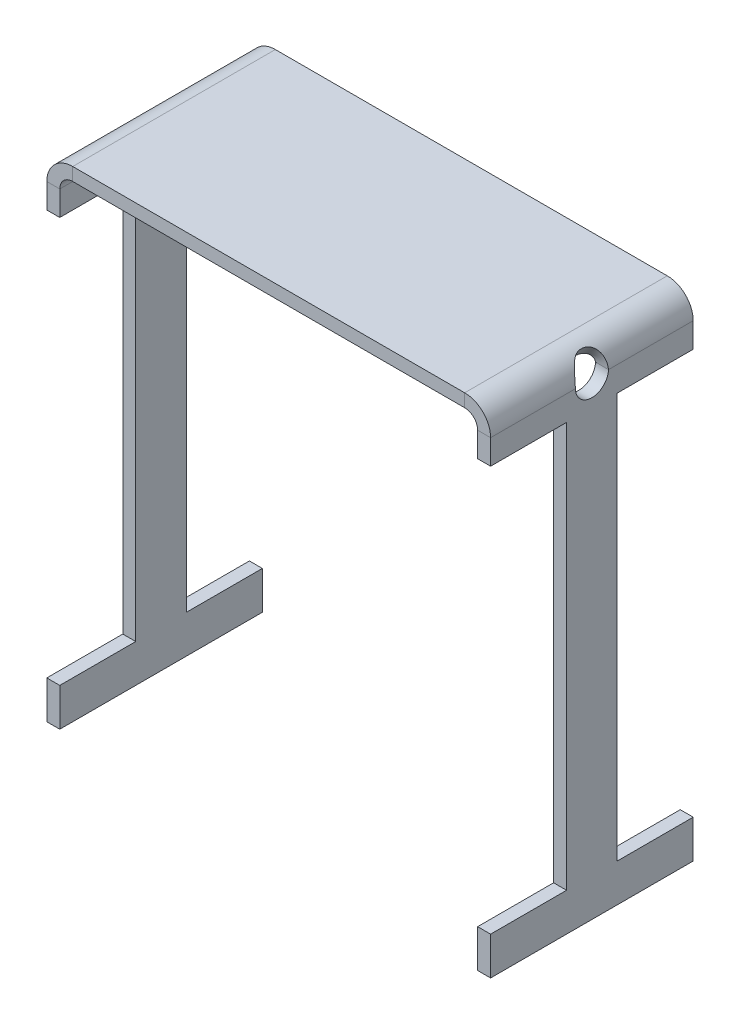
ISO-10303-21;
HEADER;
FILE_DESCRIPTION(('STEP AP214'),'2;1');
FILE_NAME('part.step','',(''),(''),'','','');
FILE_SCHEMA(('AUTOMOTIVE_DESIGN { 1 0 10303 214 1 1 1 1 }'));
ENDSEC;
DATA;
#1=APPLICATION_CONTEXT('core data for automotive mechanical design processes');
#2=APPLICATION_PROTOCOL_DEFINITION('international standard','automotive_design',2000,#1);
#3=PRODUCT_CONTEXT('',#1,'mechanical');
#4=PRODUCT('Part','Part','',(#3));
#5=PRODUCT_RELATED_PRODUCT_CATEGORY('part','',(#4));
#6=PRODUCT_DEFINITION_FORMATION('','',#4);
#7=PRODUCT_DEFINITION_CONTEXT('part definition',#1,'design');
#8=PRODUCT_DEFINITION('design','',#6,#7);
#9=PRODUCT_DEFINITION_SHAPE('','',#8);
#10=(LENGTH_UNIT() NAMED_UNIT(*) SI_UNIT(.MILLI.,.METRE.));
#11=(NAMED_UNIT(*) PLANE_ANGLE_UNIT() SI_UNIT($,.RADIAN.));
#12=(NAMED_UNIT(*) SI_UNIT($,.STERADIAN.) SOLID_ANGLE_UNIT());
#13=UNCERTAINTY_MEASURE_WITH_UNIT(LENGTH_MEASURE(1.E-05),#10,'distance_accuracy_value','');
#14=(GEOMETRIC_REPRESENTATION_CONTEXT(3) GLOBAL_UNCERTAINTY_ASSIGNED_CONTEXT((#13)) GLOBAL_UNIT_ASSIGNED_CONTEXT((#10,
#11,#12)) REPRESENTATION_CONTEXT('',''));
#15=CARTESIAN_POINT('',(0.,0.,0.));
#16=DIRECTION('',(0.,0.,1.));
#17=DIRECTION('',(1.,0.,0.));
#18=AXIS2_PLACEMENT_3D('',#15,#16,#17);
#19=CARTESIAN_POINT('',(-13.096875,30.14345,6.35));
#20=DIRECTION('',(0.,1.,0.));
#21=DIRECTION('',(0.,0.,1.));
#22=AXIS2_PLACEMENT_3D('',#19,#20,#21);
#23=PLANE('',#22);
#24=DIRECTION('',(0.,0.,1.));
#25=VECTOR('',#24,1.);
#26=CARTESIAN_POINT('',(-12.284075,30.14345,-6.35));
#27=LINE('',#26,#25);
#28=CARTESIAN_POINT('',(-12.284075,30.14345,-6.35));
#29=VERTEX_POINT('',#28);
#30=CARTESIAN_POINT('',(-12.284075,30.14345,6.35));
#31=VERTEX_POINT('',#30);
#32=EDGE_CURVE('E48',#29,#31,#27,.T.);
#33=ORIENTED_EDGE('',*,*,#32,.F.);
#34=DIRECTION('',(1.,0.,0.));
#35=VECTOR('',#34,1.);
#36=CARTESIAN_POINT('',(-13.096875,30.14345,-6.35));
#37=LINE('',#36,#35);
#38=CARTESIAN_POINT('',(12.284075,30.14345,-6.35));
#39=VERTEX_POINT('',#38);
#40=EDGE_CURVE('E63',#29,#39,#37,.T.);
#41=ORIENTED_EDGE('',*,*,#40,.T.);
#42=DIRECTION('',(0.,0.,-1.));
#43=VECTOR('',#42,1.);
#44=CARTESIAN_POINT('',(12.284075,30.14345,6.35));
#45=LINE('',#44,#43);
#46=CARTESIAN_POINT('',(12.284075,30.14345,6.35));
#47=VERTEX_POINT('',#46);
#48=EDGE_CURVE('E533',#47,#39,#45,.T.);
#49=ORIENTED_EDGE('',*,*,#48,.F.);
#50=DIRECTION('',(1.,0.,0.));
#51=VECTOR('',#50,1.);
#52=CARTESIAN_POINT('',(-13.096875,30.14345,6.35));
#53=LINE('',#52,#51);
#54=EDGE_CURVE('E55',#31,#47,#53,.T.);
#55=ORIENTED_EDGE('',*,*,#54,.F.);
#56=EDGE_LOOP('',(#33,#41,#49,#55));
#57=FACE_BOUND('',#56,.T.);
#58=ADVANCED_FACE('F41',(#57),#23,.F.);
#59=CARTESIAN_POINT('',(-13.096875,30.95625,6.35));
#60=DIRECTION('',(0.,1.,0.));
#61=DIRECTION('',(0.,0.,1.));
#62=AXIS2_PLACEMENT_3D('',#59,#60,#61);
#63=PLANE('',#62);
#64=DIRECTION('',(1.,0.,0.));
#65=VECTOR('',#64,1.);
#66=CARTESIAN_POINT('',(-13.096875,30.95625,-6.35));
#67=LINE('',#66,#65);
#68=CARTESIAN_POINT('',(-12.284075,30.95625,-6.35));
#69=VERTEX_POINT('',#68);
#70=CARTESIAN_POINT('',(12.284075,30.9562500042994,-6.35));
#71=VERTEX_POINT('',#70);
#72=EDGE_CURVE('E522',#69,#71,#67,.T.);
#73=ORIENTED_EDGE('',*,*,#72,.F.);
#74=DIRECTION('',(0.,0.,1.));
#75=VECTOR('',#74,1.);
#76=CARTESIAN_POINT('',(-12.284075,30.95625,-6.35));
#77=LINE('',#76,#75);
#78=CARTESIAN_POINT('',(-12.284075,30.9562500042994,6.35));
#79=VERTEX_POINT('',#78);
#80=EDGE_CURVE('E539',#69,#79,#77,.T.);
#81=ORIENTED_EDGE('',*,*,#80,.T.);
#82=DIRECTION('',(1.,0.,0.));
#83=VECTOR('',#82,1.);
#84=CARTESIAN_POINT('',(-13.096875,30.95625,6.35));
#85=LINE('',#84,#83);
#86=CARTESIAN_POINT('',(12.284075,30.95625,6.35));
#87=VERTEX_POINT('',#86);
#88=EDGE_CURVE('E525',#79,#87,#85,.T.);
#89=ORIENTED_EDGE('',*,*,#88,.T.);
#90=DIRECTION('',(0.,0.,-1.));
#91=VECTOR('',#90,1.);
#92=CARTESIAN_POINT('',(12.284075,30.95625,6.35));
#93=LINE('',#92,#91);
#94=EDGE_CURVE('E527',#87,#71,#93,.T.);
#95=ORIENTED_EDGE('',*,*,#94,.T.);
#96=EDGE_LOOP('',(#73,#81,#89,#95));
#97=FACE_BOUND('',#96,.T.);
#98=ADVANCED_FACE('F638',(#97),#63,.T.);
#99=CARTESIAN_POINT('',(13.096875,30.14345,6.35));
#100=DIRECTION('',(0.,0.,-1.));
#101=DIRECTION('',(-1.,0.,0.));
#102=AXIS2_PLACEMENT_3D('',#99,#100,#101);
#103=PLANE('',#102);
#104=DIRECTION('',(0.,1.,0.));
#105=VECTOR('',#104,1.);
#106=CARTESIAN_POINT('',(-12.284075,30.14345,6.35));
#107=LINE('',#106,#105);
#108=EDGE_CURVE('E12',#31,#79,#107,.T.);
#109=ORIENTED_EDGE('',*,*,#108,.F.);
#110=ORIENTED_EDGE('',*,*,#54,.T.);
#111=DIRECTION('',(0.,1.,0.));
#112=VECTOR('',#111,1.);
#113=CARTESIAN_POINT('',(12.284075,30.14345,6.35));
#114=LINE('',#113,#112);
#115=EDGE_CURVE('E530',#47,#87,#114,.T.);
#116=ORIENTED_EDGE('',*,*,#115,.T.);
#117=ORIENTED_EDGE('',*,*,#88,.F.);
#118=EDGE_LOOP('',(#109,#110,#116,#117));
#119=FACE_BOUND('',#118,.T.);
#120=ADVANCED_FACE('F640',(#119),#103,.F.);
#121=CARTESIAN_POINT('',(13.096875,30.14345,-6.35));
#122=DIRECTION('',(0.,0.,-1.));
#123=DIRECTION('',(-1.,0.,0.));
#124=AXIS2_PLACEMENT_3D('',#121,#122,#123);
#125=PLANE('',#124);
#126=ORIENTED_EDGE('',*,*,#40,.F.);
#127=DIRECTION('',(0.,1.,0.));
#128=VECTOR('',#127,1.);
#129=CARTESIAN_POINT('',(-12.284075,30.14345,-6.35));
#130=LINE('',#129,#128);
#131=EDGE_CURVE('E587',#29,#69,#130,.T.);
#132=ORIENTED_EDGE('',*,*,#131,.T.);
#133=ORIENTED_EDGE('',*,*,#72,.T.);
#134=DIRECTION('',(0.,1.,0.));
#135=VECTOR('',#134,1.);
#136=CARTESIAN_POINT('',(12.284075,30.14345,-6.35));
#137=LINE('',#136,#135);
#138=EDGE_CURVE('E536',#39,#71,#137,.T.);
#139=ORIENTED_EDGE('',*,*,#138,.F.);
#140=EDGE_LOOP('',(#126,#132,#133,#139));
#141=FACE_BOUND('',#140,.T.);
#142=ADVANCED_FACE('F476',(#141),#125,.T.);
#143=CARTESIAN_POINT('',(13.9096750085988,29.33065,1.04070281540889));
#144=CARTESIAN_POINT('',(13.9096750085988,29.5245298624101,1.04113754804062));
#145=CARTESIAN_POINT('',(13.8751189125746,29.702292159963,1.0223352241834));
#146=CARTESIAN_POINT('',(13.795272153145,29.9352981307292,0.965279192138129));
#147=CARTESIAN_POINT('',(13.7639795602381,30.0074415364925,0.941451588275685));
#148=CARTESIAN_POINT('',(13.7127061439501,30.1071715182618,0.898496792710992));
#149=CARTESIAN_POINT('',(13.694889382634,30.1390072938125,0.882976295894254));
#150=CARTESIAN_POINT('',(13.6673788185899,30.1846767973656,0.857892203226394));
#151=CARTESIAN_POINT('',(13.6580774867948,30.1995529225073,0.849230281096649));
#152=CARTESIAN_POINT('',(13.6439644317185,30.2213525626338,0.83578656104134));
#153=CARTESIAN_POINT('',(13.6392332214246,30.2285333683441,0.831230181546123));
#154=CARTESIAN_POINT('',(13.6321004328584,30.2391768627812,0.824282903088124));
#155=CARTESIAN_POINT('',(13.629716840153,30.242703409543,0.821948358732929));
#156=CARTESIAN_POINT('',(13.6261329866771,30.2479614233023,0.818418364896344));
#157=CARTESIAN_POINT('',(13.6249369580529,30.2497087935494,0.817237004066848));
#158=CARTESIAN_POINT('',(13.6225421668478,30.2531929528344,0.814864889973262));
#159=CARTESIAN_POINT('',(13.6217836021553,30.2542946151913,0.814112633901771));
#160=CARTESIAN_POINT('',(13.5151651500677,30.4081259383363,0.707906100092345));
#161=CARTESIAN_POINT('',(13.4133543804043,30.5035468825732,0.588273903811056));
#162=CARTESIAN_POINT('',(13.3092153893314,30.5930914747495,0.386236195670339));
#163=CARTESIAN_POINT('',(13.2821284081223,30.6139954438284,0.315125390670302));
#164=CARTESIAN_POINT('',(13.2550819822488,30.6344323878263,0.202811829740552));
#165=CARTESIAN_POINT('',(13.2483123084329,30.639409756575,0.164432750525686));
#166=CARTESIAN_POINT('',(13.2416483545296,30.6442847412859,0.105452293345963));
#167=CARTESIAN_POINT('',(13.2400078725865,30.645476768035,0.0855568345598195));
#168=CARTESIAN_POINT('',(13.2384256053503,30.6466252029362,0.0553606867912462));
#169=CARTESIAN_POINT('',(13.238044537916,30.6469013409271,0.0452364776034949));
#170=CARTESIAN_POINT('',(13.2375756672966,30.6472410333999,0.0248704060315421));
#171=CARTESIAN_POINT('',(13.2374927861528,30.6473010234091,0.0137676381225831));
#172=CARTESIAN_POINT('',(13.238410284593,30.6466365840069,-0.146708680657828));
#173=CARTESIAN_POINT('',(13.2655413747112,30.6281306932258,-0.281757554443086));
#174=CARTESIAN_POINT('',(13.3652185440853,30.5463230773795,-0.519879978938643));
#175=CARTESIAN_POINT('',(13.4380701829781,30.4827023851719,-0.622953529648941));
#176=CARTESIAN_POINT('',(13.6040200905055,30.2880812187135,-0.797125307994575));
#177=CARTESIAN_POINT('',(13.6974310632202,30.1562362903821,-0.868223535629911));
#178=CARTESIAN_POINT('',(13.8504707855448,29.8055945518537,-0.978444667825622));
#179=CARTESIAN_POINT('',(13.9096750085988,29.5863113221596,-1.01748032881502));
#180=CARTESIAN_POINT('',(13.9096750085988,29.33065,-1.04070281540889));
#181=CARTESIAN_POINT('',(13.0968750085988,29.33065,1.04070281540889));
#182=CARTESIAN_POINT('',(13.0968750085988,29.4275899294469,1.04113754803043));
#183=CARTESIAN_POINT('',(13.0795969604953,29.5164710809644,1.0223352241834));
#184=CARTESIAN_POINT('',(13.0396735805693,29.6329740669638,0.965279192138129));
#185=CARTESIAN_POINT('',(13.0240272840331,29.6690457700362,0.941451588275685));
#186=CARTESIAN_POINT('',(12.9983905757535,29.7189107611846,0.898496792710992));
#187=CARTESIAN_POINT('',(12.9894821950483,29.7348286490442,0.882976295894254));
#188=CARTESIAN_POINT('',(12.9757269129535,29.7576634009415,0.857892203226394));
#189=CARTESIAN_POINT('',(12.9710762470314,29.7651014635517,0.849230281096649));
#190=CARTESIAN_POINT('',(12.9640197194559,29.7760012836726,0.83578656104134));
#191=CARTESIAN_POINT('',(12.9616541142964,29.7795916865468,0.831230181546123));
#192=CARTESIAN_POINT('',(12.9580877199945,29.7849134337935,0.824282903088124));
#193=CARTESIAN_POINT('',(12.9568959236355,29.7866767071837,0.821948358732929));
#194=CARTESIAN_POINT('',(12.955103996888,29.7893057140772,0.818418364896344));
#195=CARTESIAN_POINT('',(12.9545059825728,29.7901793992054,0.817237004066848));
#196=CARTESIAN_POINT('',(12.9533085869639,29.7919214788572,0.814864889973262));
#197=CARTESIAN_POINT('',(12.9529293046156,29.7924723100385,0.814112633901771));
#198=CARTESIAN_POINT('',(12.8996200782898,29.8693879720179,0.707906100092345));
#199=CARTESIAN_POINT('',(12.8487146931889,29.9170984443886,0.588273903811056));
#200=CARTESIAN_POINT('',(12.796645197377,29.9618707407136,0.386236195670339));
#201=CARTESIAN_POINT('',(12.7831017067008,29.9723227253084,0.315125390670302));
#202=CARTESIAN_POINT('',(12.7695784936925,29.9825411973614,0.202811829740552));
#203=CARTESIAN_POINT('',(12.7661936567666,29.9850298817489,0.164432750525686));
#204=CARTESIAN_POINT('',(12.7628616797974,29.9874673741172,0.105452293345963));
#205=CARTESIAN_POINT('',(12.7620414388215,29.988063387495,0.0855568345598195));
#206=CARTESIAN_POINT('',(12.7612503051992,29.9886376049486,0.0553606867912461));
#207=CARTESIAN_POINT('',(12.7610597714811,29.9887756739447,0.045236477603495));
#208=CARTESIAN_POINT('',(12.7608253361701,29.988945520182,0.0248704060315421));
#209=CARTESIAN_POINT('',(12.760783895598,29.9889755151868,0.0137676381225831));
#210=CARTESIAN_POINT('',(12.7612426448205,29.988643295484,-0.146708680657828));
#211=CARTESIAN_POINT('',(12.7748081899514,29.9793903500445,-0.281757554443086));
#212=CARTESIAN_POINT('',(12.824646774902,29.9384865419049,-0.519879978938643));
#213=CARTESIAN_POINT('',(12.8610725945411,29.9066761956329,-0.622953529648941));
#214=CARTESIAN_POINT('',(12.9440475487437,29.809365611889,-0.797125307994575));
#215=CARTESIAN_POINT('',(12.9907530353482,29.7434431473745,-0.868223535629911));
#216=CARTESIAN_POINT('',(13.0672728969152,29.568122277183,-0.978444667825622));
#217=CARTESIAN_POINT('',(13.0968750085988,29.4584691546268,-1.0174824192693));
#218=CARTESIAN_POINT('',(13.0968750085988,29.33065,-1.04070281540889));
#219=B_SPLINE_SURFACE_WITH_KNOTS('',1,3,((#143,#144,#145,#146,#147,#148,#149,#150,#151,#152,
#153,#154,#155,#156,#157,#158,#159,#160,#161,#162,#163,#164,#165,#166,#167,#168,#169,#170,#171,
#172,#173,#174,#175,#176,#177,#178,#179,#180),(#181,#182,#183,#184,#185,#186,#187,#188,#189,
#190,#191,#192,#193,#194,#195,#196,#197,#198,#199,#200,#201,#202,#203,#204,#205,#206,#207,#208,
#209,#210,#211,#212,#213,#214,#215,#216,#217,#218)),.UNSPECIFIED.,.F.,.F.,.F.,(2,2),(4,2,2,2,2,
2,2,2,2,2,2,2,2,2,2,2,2,2,4),(0.,1.),(0.,0.125,0.1875,0.21875,0.234375,0.2421875,0.24609375,
0.248046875,0.25,0.375,0.4375,0.46875,0.484375,0.4921875,0.5,0.625,0.75,0.875,1.),.UNSPECIFIED.);
#220=CARTESIAN_POINT('',(13.9096750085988,29.33065,1.04070281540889));
#221=CARTESIAN_POINT('',(13.0968750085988,29.33065,1.04070281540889));
#222=B_SPLINE_CURVE_WITH_KNOTS('',1,(#220,#221),.UNSPECIFIED.,.F.,.F.,(2,2),(0.,1.),.UNSPECIFIED.);
#223=CARTESIAN_POINT('',(13.909675,29.33065,1.04070281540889));
#224=VERTEX_POINT('',#223);
#225=CARTESIAN_POINT('',(13.096875,29.33065,1.04070281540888));
#226=VERTEX_POINT('',#225);
#227=EDGE_CURVE('E511',#224,#226,#222,.T.);
#228=CARTESIAN_POINT('',(13.0968750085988,29.33065,1.04070281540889));
#229=CARTESIAN_POINT('',(13.0968750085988,29.4275899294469,1.04113754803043));
#230=CARTESIAN_POINT('',(13.0795969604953,29.5164710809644,1.0223352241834));
#231=CARTESIAN_POINT('',(13.0396735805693,29.6329740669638,0.965279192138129));
#232=CARTESIAN_POINT('',(13.0240272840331,29.6690457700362,0.941451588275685));
#233=CARTESIAN_POINT('',(12.9983905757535,29.7189107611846,0.898496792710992));
#234=CARTESIAN_POINT('',(12.9894821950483,29.7348286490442,0.882976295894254));
#235=CARTESIAN_POINT('',(12.9757269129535,29.7576634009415,0.857892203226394));
#236=CARTESIAN_POINT('',(12.9710762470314,29.7651014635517,0.849230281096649));
#237=CARTESIAN_POINT('',(12.9640197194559,29.7760012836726,0.83578656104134));
#238=CARTESIAN_POINT('',(12.9616541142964,29.7795916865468,0.831230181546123));
#239=CARTESIAN_POINT('',(12.9580877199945,29.7849134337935,0.824282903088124));
#240=CARTESIAN_POINT('',(12.9568959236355,29.7866767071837,0.821948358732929));
#241=CARTESIAN_POINT('',(12.955103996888,29.7893057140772,0.818418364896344));
#242=CARTESIAN_POINT('',(12.9545059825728,29.7901793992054,0.817237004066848));
#243=CARTESIAN_POINT('',(12.9533085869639,29.7919214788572,0.814864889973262));
#244=CARTESIAN_POINT('',(12.9529293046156,29.7924723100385,0.814112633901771));
#245=CARTESIAN_POINT('',(12.8996200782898,29.8693879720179,0.707906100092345));
#246=CARTESIAN_POINT('',(12.8487146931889,29.9170984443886,0.588273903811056));
#247=CARTESIAN_POINT('',(12.796645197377,29.9618707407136,0.386236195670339));
#248=CARTESIAN_POINT('',(12.7831017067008,29.9723227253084,0.315125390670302));
#249=CARTESIAN_POINT('',(12.7695784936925,29.9825411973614,0.202811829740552));
#250=CARTESIAN_POINT('',(12.7661936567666,29.9850298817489,0.164432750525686));
#251=CARTESIAN_POINT('',(12.7628616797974,29.9874673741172,0.105452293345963));
#252=CARTESIAN_POINT('',(12.7620414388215,29.988063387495,0.0855568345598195));
#253=CARTESIAN_POINT('',(12.7612503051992,29.9886376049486,0.0553606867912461));
#254=CARTESIAN_POINT('',(12.7610597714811,29.9887756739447,0.045236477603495));
#255=CARTESIAN_POINT('',(12.7608253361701,29.988945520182,0.0248704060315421));
#256=CARTESIAN_POINT('',(12.760783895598,29.9889755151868,0.0137676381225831));
#257=CARTESIAN_POINT('',(12.7612426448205,29.988643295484,-0.146708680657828));
#258=CARTESIAN_POINT('',(12.7748081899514,29.9793903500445,-0.281757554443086));
#259=CARTESIAN_POINT('',(12.824646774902,29.9384865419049,-0.519879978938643));
#260=CARTESIAN_POINT('',(12.8610725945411,29.9066761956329,-0.622953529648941));
#261=CARTESIAN_POINT('',(12.9440475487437,29.809365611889,-0.797125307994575));
#262=CARTESIAN_POINT('',(12.9907530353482,29.7434431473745,-0.868223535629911));
#263=CARTESIAN_POINT('',(13.0672728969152,29.568122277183,-0.978444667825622));
#264=CARTESIAN_POINT('',(13.0968750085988,29.4584691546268,-1.0174824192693));
#265=CARTESIAN_POINT('',(13.0968750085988,29.33065,-1.04070281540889));
#266=B_SPLINE_CURVE_WITH_KNOTS('',3,(#228,#229,#230,#231,#232,#233,#234,#235,#236,#237,#238,
#239,#240,#241,#242,#243,#244,#245,#246,#247,#248,#249,#250,#251,#252,#253,#254,#255,#256,#257,
#258,#259,#260,#261,#262,#263,#264,#265),.UNSPECIFIED.,.F.,.F.,(4,2,2,2,2,2,2,2,2,2,2,2,2,2,2,2,
2,2,4),(0.,0.125,0.1875,0.21875,0.234375,0.2421875,0.24609375,0.248046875,0.25,0.375,0.4375,
0.46875,0.484375,0.4921875,0.5,0.625,0.75,0.875,1.),.UNSPECIFIED.);
#267=CARTESIAN_POINT('',(13.096875,29.33065,-1.04070281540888));
#268=VERTEX_POINT('',#267);
#269=EDGE_CURVE('E344',#226,#268,#266,.T.);
#270=CARTESIAN_POINT('',(13.0968750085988,29.33065,-1.04070281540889));
#271=CARTESIAN_POINT('',(13.9096750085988,29.33065,-1.04070281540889));
#272=B_SPLINE_CURVE_WITH_KNOTS('',1,(#270,#271),.UNSPECIFIED.,.F.,.F.,(2,2),(0.,1.),.UNSPECIFIED.);
#273=CARTESIAN_POINT('',(13.909675,29.33065,-1.04070281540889));
#274=VERTEX_POINT('',#273);
#275=EDGE_CURVE('E551',#268,#274,#272,.T.);
#276=CARTESIAN_POINT('',(13.9096750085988,29.33065,-1.04070281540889));
#277=CARTESIAN_POINT('',(13.9096750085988,29.5863113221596,-1.01748032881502));
#278=CARTESIAN_POINT('',(13.8504707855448,29.8055945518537,-0.978444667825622));
#279=CARTESIAN_POINT('',(13.6974310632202,30.1562362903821,-0.868223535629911));
#280=CARTESIAN_POINT('',(13.6040200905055,30.2880812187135,-0.797125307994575));
#281=CARTESIAN_POINT('',(13.4380701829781,30.4827023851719,-0.622953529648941));
#282=CARTESIAN_POINT('',(13.3652185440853,30.5463230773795,-0.519879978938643));
#283=CARTESIAN_POINT('',(13.2655413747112,30.6281306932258,-0.281757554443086));
#284=CARTESIAN_POINT('',(13.238410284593,30.6466365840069,-0.146708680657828));
#285=CARTESIAN_POINT('',(13.2374927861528,30.6473010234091,0.0137676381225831));
#286=CARTESIAN_POINT('',(13.2375756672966,30.6472410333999,0.0248704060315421));
#287=CARTESIAN_POINT('',(13.238044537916,30.6469013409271,0.0452364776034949));
#288=CARTESIAN_POINT('',(13.2384256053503,30.6466252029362,0.0553606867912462));
#289=CARTESIAN_POINT('',(13.2400078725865,30.645476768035,0.0855568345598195));
#290=CARTESIAN_POINT('',(13.2416483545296,30.6442847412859,0.105452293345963));
#291=CARTESIAN_POINT('',(13.2483123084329,30.639409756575,0.164432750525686));
#292=CARTESIAN_POINT('',(13.2550819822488,30.6344323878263,0.202811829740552));
#293=CARTESIAN_POINT('',(13.2821284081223,30.6139954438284,0.315125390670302));
#294=CARTESIAN_POINT('',(13.3092153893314,30.5930914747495,0.386236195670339));
#295=CARTESIAN_POINT('',(13.4133543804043,30.5035468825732,0.588273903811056));
#296=CARTESIAN_POINT('',(13.5151651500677,30.4081259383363,0.707906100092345));
#297=CARTESIAN_POINT('',(13.6217836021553,30.2542946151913,0.814112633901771));
#298=CARTESIAN_POINT('',(13.6225421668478,30.2531929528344,0.814864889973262));
#299=CARTESIAN_POINT('',(13.6249369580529,30.2497087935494,0.817237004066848));
#300=CARTESIAN_POINT('',(13.6261329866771,30.2479614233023,0.818418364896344));
#301=CARTESIAN_POINT('',(13.629716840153,30.242703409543,0.821948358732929));
#302=CARTESIAN_POINT('',(13.6321004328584,30.2391768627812,0.824282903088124));
#303=CARTESIAN_POINT('',(13.6392332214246,30.2285333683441,0.831230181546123));
#304=CARTESIAN_POINT('',(13.6439644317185,30.2213525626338,0.83578656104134));
#305=CARTESIAN_POINT('',(13.6580774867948,30.1995529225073,0.849230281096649));
#306=CARTESIAN_POINT('',(13.6673788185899,30.1846767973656,0.857892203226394));
#307=CARTESIAN_POINT('',(13.694889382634,30.1390072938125,0.882976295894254));
#308=CARTESIAN_POINT('',(13.7127061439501,30.1071715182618,0.898496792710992));
#309=CARTESIAN_POINT('',(13.7639795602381,30.0074415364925,0.941451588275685));
#310=CARTESIAN_POINT('',(13.795272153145,29.9352981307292,0.965279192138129));
#311=CARTESIAN_POINT('',(13.8751189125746,29.702292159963,1.0223352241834));
#312=CARTESIAN_POINT('',(13.9096750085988,29.5245298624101,1.04113754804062));
#313=CARTESIAN_POINT('',(13.9096750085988,29.33065,1.04070281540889));
#314=B_SPLINE_CURVE_WITH_KNOTS('',3,(#276,#277,#278,#279,#280,#281,#282,#283,#284,#285,#286,
#287,#288,#289,#290,#291,#292,#293,#294,#295,#296,#297,#298,#299,#300,#301,#302,#303,#304,#305,
#306,#307,#308,#309,#310,#311,#312,#313),.UNSPECIFIED.,.F.,.F.,(4,2,2,2,2,2,2,2,2,2,2,2,2,2,2,2,
2,2,4),(0.,0.125,0.25,0.375,0.5,0.5078125,0.515625,0.53125,0.5625,0.625,0.75,0.751953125,
0.75390625,0.7578125,0.765625,0.78125,0.8125,0.875,1.),.UNSPECIFIED.);
#315=EDGE_CURVE('E432',#224,#274,#314,.F.);
#316=ORIENTED_EDGE('',*,*,#227,.T.);
#317=ORIENTED_EDGE('',*,*,#269,.T.);
#318=ORIENTED_EDGE('',*,*,#275,.T.);
#319=ORIENTED_EDGE('',*,*,#315,.F.);
#320=EDGE_LOOP('',(#316,#317,#318,#319));
#321=FACE_BOUND('',#320,.T.);
#322=ADVANCED_FACE('F469',(#321),#219,.T.);
#323=CARTESIAN_POINT('',(12.284075,29.3306499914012,-6.35));
#324=DIRECTION('',(0.,0.,-1.));
#325=DIRECTION('',(-1.,0.,0.));
#326=AXIS2_PLACEMENT_3D('',#323,#324,#325);
#327=PLANE('',#326);
#328=DIRECTION('',(1.,0.,0.));
#329=VECTOR('',#328,1.);
#330=CARTESIAN_POINT('',(13.096875,29.33065,-6.35));
#331=LINE('',#330,#329);
#332=CARTESIAN_POINT('',(13.096875,29.33065,-6.35));
#333=VERTEX_POINT('',#332);
#334=CARTESIAN_POINT('',(13.9096750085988,29.33065,-6.35));
#335=VERTEX_POINT('',#334);
#336=EDGE_CURVE('E342',#333,#335,#331,.T.);
#337=ORIENTED_EDGE('',*,*,#336,.F.);
#338=CARTESIAN_POINT('',(12.284075,29.33065,-6.35));
#339=DIRECTION('',(0.,0.,-1.));
#340=DIRECTION('',(-1.,0.,0.));
#341=AXIS2_PLACEMENT_3D('',#338,#339,#340);
#342=CIRCLE('',#341,0.812800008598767);
#343=EDGE_CURVE('E433',#333,#39,#342,.F.);
#344=ORIENTED_EDGE('',*,*,#343,.T.);
#345=ORIENTED_EDGE('',*,*,#138,.T.);
#346=CARTESIAN_POINT('',(12.284075,29.3306499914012,-6.35));
#347=DIRECTION('',(0.,0.,1.));
#348=DIRECTION('',(1.,0.,0.));
#349=AXIS2_PLACEMENT_3D('',#346,#347,#348);
#350=CIRCLE('',#349,1.62560001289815);
#351=EDGE_CURVE('E436',#335,#71,#350,.T.);
#352=ORIENTED_EDGE('',*,*,#351,.F.);
#353=EDGE_LOOP('',(#337,#344,#345,#352));
#354=FACE_BOUND('',#353,.T.);
#355=ADVANCED_FACE('F465',(#354),#327,.T.);
#356=CARTESIAN_POINT('',(12.284075,29.3306499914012,6.35));
#357=DIRECTION('',(0.,0.,1.));
#358=DIRECTION('',(1.,0.,0.));
#359=AXIS2_PLACEMENT_3D('',#356,#357,#358);
#360=PLANE('',#359);
#361=ORIENTED_EDGE('',*,*,#115,.F.);
#362=CARTESIAN_POINT('',(12.284075,29.33065,6.35));
#363=DIRECTION('',(0.,0.,-1.));
#364=DIRECTION('',(-1.,0.,0.));
#365=AXIS2_PLACEMENT_3D('',#362,#363,#364);
#366=CIRCLE('',#365,0.812800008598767);
#367=CARTESIAN_POINT('',(13.096875,29.33065,6.35));
#368=VERTEX_POINT('',#367);
#369=EDGE_CURVE('E429',#47,#368,#366,.T.);
#370=ORIENTED_EDGE('',*,*,#369,.T.);
#371=DIRECTION('',(1.,0.,0.));
#372=VECTOR('',#371,1.);
#373=CARTESIAN_POINT('',(13.096875,29.33065,6.35));
#374=LINE('',#373,#372);
#375=CARTESIAN_POINT('',(13.9096750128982,29.33065,6.35));
#376=VERTEX_POINT('',#375);
#377=EDGE_CURVE('E425',#368,#376,#374,.T.);
#378=ORIENTED_EDGE('',*,*,#377,.T.);
#379=CARTESIAN_POINT('',(12.284075,29.3306499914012,6.35));
#380=DIRECTION('',(0.,0.,-1.));
#381=DIRECTION('',(-1.,0.,0.));
#382=AXIS2_PLACEMENT_3D('',#379,#380,#381);
#383=CIRCLE('',#382,1.62560001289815);
#384=EDGE_CURVE('E439',#87,#376,#383,.T.);
#385=ORIENTED_EDGE('',*,*,#384,.F.);
#386=EDGE_LOOP('',(#361,#370,#378,#385));
#387=FACE_BOUND('',#386,.T.);
#388=ADVANCED_FACE('F459',(#387),#360,.T.);
#389=CARTESIAN_POINT('',(12.284075,29.33065,12.8508983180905));
#390=DIRECTION('',(0.,0.,-1.));
#391=DIRECTION('',(-1.,0.,0.));
#392=AXIS2_PLACEMENT_3D('',#389,#390,#391);
#393=CYLINDRICAL_SURFACE('',#392,1.62560000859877);
#394=ORIENTED_EDGE('',*,*,#384,.T.);
#395=DIRECTION('',(0.,0.,-1.));
#396=VECTOR('',#395,1.);
#397=CARTESIAN_POINT('',(13.909675,29.33065,6.35));
#398=LINE('',#397,#396);
#399=EDGE_CURVE('E576',#376,#224,#398,.T.);
#400=ORIENTED_EDGE('',*,*,#399,.T.);
#401=ORIENTED_EDGE('',*,*,#315,.T.);
#402=DIRECTION('',(0.,0.,-1.));
#403=VECTOR('',#402,1.);
#404=CARTESIAN_POINT('',(13.909675,29.33065,6.35));
#405=LINE('',#404,#403);
#406=EDGE_CURVE('E341',#274,#335,#405,.T.);
#407=ORIENTED_EDGE('',*,*,#406,.T.);
#408=ORIENTED_EDGE('',*,*,#351,.T.);
#409=ORIENTED_EDGE('',*,*,#94,.F.);
#410=EDGE_LOOP('',(#394,#400,#401,#407,#408,#409));
#411=FACE_BOUND('',#410,.T.);
#412=ADVANCED_FACE('F448',(#411),#393,.T.);
#413=CARTESIAN_POINT('',(12.284075,29.33065,12.8508983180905));
#414=DIRECTION('',(0.,0.,-1.));
#415=DIRECTION('',(-1.,0.,0.));
#416=AXIS2_PLACEMENT_3D('',#413,#414,#415);
#417=CYLINDRICAL_SURFACE('',#416,0.812800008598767);
#418=ORIENTED_EDGE('',*,*,#369,.F.);
#419=ORIENTED_EDGE('',*,*,#48,.T.);
#420=ORIENTED_EDGE('',*,*,#343,.F.);
#421=DIRECTION('',(0.,0.,1.));
#422=VECTOR('',#421,1.);
#423=CARTESIAN_POINT('',(13.096875,29.33065,-6.35));
#424=LINE('',#423,#422);
#425=EDGE_CURVE('E545',#333,#268,#424,.T.);
#426=ORIENTED_EDGE('',*,*,#425,.T.);
#427=ORIENTED_EDGE('',*,*,#269,.F.);
#428=DIRECTION('',(0.,0.,1.));
#429=VECTOR('',#428,1.);
#430=CARTESIAN_POINT('',(13.096875,29.33065,-6.35));
#431=LINE('',#430,#429);
#432=EDGE_CURVE('E428',#226,#368,#431,.T.);
#433=ORIENTED_EDGE('',*,*,#432,.T.);
#434=EDGE_LOOP('',(#418,#419,#420,#426,#427,#433));
#435=FACE_BOUND('',#434,.T.);
#436=ADVANCED_FACE('F458',(#435),#417,.F.);
#437=CARTESIAN_POINT('',(13.9096750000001,2.38124999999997,-1.5875));
#438=DIRECTION('',(0.,-1.,0.));
#439=DIRECTION('',(1.,0.,0.));
#440=AXIS2_PLACEMENT_3D('',#437,#438,#439);
#441=PLANE('',#440);
#442=DIRECTION('',(0.,0.,1.));
#443=VECTOR('',#442,1.);
#444=CARTESIAN_POINT('',(13.0968749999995,2.38124999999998,-1.5875));
#445=LINE('',#444,#443);
#446=CARTESIAN_POINT('',(13.0968749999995,2.38124999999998,-6.35));
#447=VERTEX_POINT('',#446);
#448=CARTESIAN_POINT('',(13.0968749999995,2.38124999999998,-1.5875));
#449=VERTEX_POINT('',#448);
#450=EDGE_CURVE('E422',#447,#449,#445,.T.);
#451=ORIENTED_EDGE('',*,*,#450,.T.);
#452=DIRECTION('',(-1.,0.,0.));
#453=VECTOR('',#452,1.);
#454=CARTESIAN_POINT('',(13.9096750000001,2.38124999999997,-1.5875));
#455=LINE('',#454,#453);
#456=CARTESIAN_POINT('',(13.9096750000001,2.38124999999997,-1.5875));
#457=VERTEX_POINT('',#456);
#458=EDGE_CURVE('E388',#457,#449,#455,.T.);
#459=ORIENTED_EDGE('',*,*,#458,.F.);
#460=DIRECTION('',(0.,0.,1.));
#461=VECTOR('',#460,1.);
#462=CARTESIAN_POINT('',(13.9096750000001,2.38124999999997,-1.5875));
#463=LINE('',#462,#461);
#464=CARTESIAN_POINT('',(13.9096750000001,2.38124999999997,-6.35));
#465=VERTEX_POINT('',#464);
#466=EDGE_CURVE('E358',#465,#457,#463,.T.);
#467=ORIENTED_EDGE('',*,*,#466,.F.);
#468=DIRECTION('',(-1.,0.,0.));
#469=VECTOR('',#468,1.);
#470=CARTESIAN_POINT('',(13.9096750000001,2.38124999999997,-6.35));
#471=LINE('',#470,#469);
#472=EDGE_CURVE('E350',#465,#447,#471,.T.);
#473=ORIENTED_EDGE('',*,*,#472,.T.);
#474=EDGE_LOOP('',(#451,#459,#467,#473));
#475=FACE_BOUND('',#474,.T.);
#476=ADVANCED_FACE('F686',(#475),#441,.F.);
#477=CARTESIAN_POINT('',(13.909675,30.14345,-6.35));
#478=DIRECTION('',(0.,0.,1.));
#479=DIRECTION('',(1.,0.,0.));
#480=AXIS2_PLACEMENT_3D('',#477,#478,#479);
#481=PLANE('',#480);
#482=DIRECTION('',(0.,1.,0.));
#483=VECTOR('',#482,1.);
#484=CARTESIAN_POINT('',(13.096875,30.14345,-6.35));
#485=LINE('',#484,#483);
#486=CARTESIAN_POINT('',(13.0968750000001,0.,-6.35));
#487=VERTEX_POINT('',#486);
#488=EDGE_CURVE('E346',#487,#447,#485,.T.);
#489=ORIENTED_EDGE('',*,*,#488,.T.);
#490=ORIENTED_EDGE('',*,*,#472,.F.);
#491=DIRECTION('',(0.,1.,0.));
#492=VECTOR('',#491,1.);
#493=CARTESIAN_POINT('',(13.909675,30.14345,-6.35));
#494=LINE('',#493,#492);
#495=CARTESIAN_POINT('',(13.9096750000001,0.,-6.35));
#496=VERTEX_POINT('',#495);
#497=EDGE_CURVE('E362',#496,#465,#494,.T.);
#498=ORIENTED_EDGE('',*,*,#497,.F.);
#499=DIRECTION('',(-1.,0.,0.));
#500=VECTOR('',#499,1.);
#501=CARTESIAN_POINT('',(13.9096750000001,0.,-6.35));
#502=LINE('',#501,#500);
#503=EDGE_CURVE('E349',#496,#487,#502,.T.);
#504=ORIENTED_EDGE('',*,*,#503,.T.);
#505=EDGE_LOOP('',(#489,#490,#498,#504));
#506=FACE_BOUND('',#505,.T.);
#507=ADVANCED_FACE('F690',(#506),#481,.F.);
#508=CARTESIAN_POINT('',(13.9096750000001,0.,-6.35));
#509=DIRECTION('',(0.,1.,0.));
#510=DIRECTION('',(-1.,0.,0.));
#511=AXIS2_PLACEMENT_3D('',#508,#509,#510);
#512=PLANE('',#511);
#513=DIRECTION('',(0.,0.,-1.));
#514=VECTOR('',#513,1.);
#515=CARTESIAN_POINT('',(13.0968750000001,0.,-6.35));
#516=LINE('',#515,#514);
#517=CARTESIAN_POINT('',(13.0968750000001,0.,6.35));
#518=VERTEX_POINT('',#517);
#519=EDGE_CURVE('E417',#518,#487,#516,.T.);
#520=ORIENTED_EDGE('',*,*,#519,.T.);
#521=ORIENTED_EDGE('',*,*,#503,.F.);
#522=DIRECTION('',(0.,0.,-1.));
#523=VECTOR('',#522,1.);
#524=CARTESIAN_POINT('',(13.9096750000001,0.,-6.35));
#525=LINE('',#524,#523);
#526=CARTESIAN_POINT('',(13.9096750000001,0.,6.35));
#527=VERTEX_POINT('',#526);
#528=EDGE_CURVE('E365',#527,#496,#525,.T.);
#529=ORIENTED_EDGE('',*,*,#528,.F.);
#530=DIRECTION('',(-1.,0.,0.));
#531=VECTOR('',#530,1.);
#532=CARTESIAN_POINT('',(13.9096750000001,0.,6.35));
#533=LINE('',#532,#531);
#534=EDGE_CURVE('E414',#527,#518,#533,.T.);
#535=ORIENTED_EDGE('',*,*,#534,.T.);
#536=EDGE_LOOP('',(#520,#521,#529,#535));
#537=FACE_BOUND('',#536,.T.);
#538=ADVANCED_FACE('F696',(#537),#512,.F.);
#539=CARTESIAN_POINT('',(13.9096750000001,0.,6.35));
#540=DIRECTION('',(0.,0.,-1.));
#541=DIRECTION('',(0.,1.,0.));
#542=AXIS2_PLACEMENT_3D('',#539,#540,#541);
#543=PLANE('',#542);
#544=DIRECTION('',(0.,-1.,0.));
#545=VECTOR('',#544,1.);
#546=CARTESIAN_POINT('',(13.9096750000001,0.,6.35));
#547=LINE('',#546,#545);
#548=CARTESIAN_POINT('',(13.9096750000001,2.38124999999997,6.35));
#549=VERTEX_POINT('',#548);
#550=EDGE_CURVE('E368',#549,#527,#547,.T.);
#551=ORIENTED_EDGE('',*,*,#550,.F.);
#552=DIRECTION('',(-1.,0.,0.));
#553=VECTOR('',#552,1.);
#554=CARTESIAN_POINT('',(13.9096750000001,2.38124999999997,6.35));
#555=LINE('',#554,#553);
#556=CARTESIAN_POINT('',(13.0968749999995,2.38124999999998,6.35));
#557=VERTEX_POINT('',#556);
#558=EDGE_CURVE('E411',#549,#557,#555,.T.);
#559=ORIENTED_EDGE('',*,*,#558,.T.);
#560=DIRECTION('',(0.,-1.,0.));
#561=VECTOR('',#560,1.);
#562=CARTESIAN_POINT('',(13.0968750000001,0.,6.35));
#563=LINE('',#562,#561);
#564=EDGE_CURVE('E359',#557,#518,#563,.T.);
#565=ORIENTED_EDGE('',*,*,#564,.T.);
#566=ORIENTED_EDGE('',*,*,#534,.F.);
#567=EDGE_LOOP('',(#551,#559,#565,#566));
#568=FACE_BOUND('',#567,.T.);
#569=ADVANCED_FACE('F701',(#568),#543,.F.);
#570=CARTESIAN_POINT('',(13.9096750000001,2.38124999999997,6.35));
#571=DIRECTION('',(0.,-1.,0.));
#572=DIRECTION('',(1.,0.,0.));
#573=AXIS2_PLACEMENT_3D('',#570,#571,#572);
#574=PLANE('',#573);
#575=DIRECTION('',(0.,0.,1.));
#576=VECTOR('',#575,1.);
#577=CARTESIAN_POINT('',(13.0968749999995,2.38124999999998,6.35));
#578=LINE('',#577,#576);
#579=CARTESIAN_POINT('',(13.0968749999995,2.38124999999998,1.5875));
#580=VERTEX_POINT('',#579);
#581=EDGE_CURVE('E409',#580,#557,#578,.T.);
#582=ORIENTED_EDGE('',*,*,#581,.T.);
#583=ORIENTED_EDGE('',*,*,#558,.F.);
#584=DIRECTION('',(0.,0.,1.));
#585=VECTOR('',#584,1.);
#586=CARTESIAN_POINT('',(13.9096750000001,2.38124999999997,6.35));
#587=LINE('',#586,#585);
#588=CARTESIAN_POINT('',(13.9096750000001,2.38124999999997,1.5875));
#589=VERTEX_POINT('',#588);
#590=EDGE_CURVE('E374',#589,#549,#587,.T.);
#591=ORIENTED_EDGE('',*,*,#590,.F.);
#592=DIRECTION('',(-1.,0.,0.));
#593=VECTOR('',#592,1.);
#594=CARTESIAN_POINT('',(13.9096750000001,2.38124999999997,1.5875));
#595=LINE('',#594,#593);
#596=EDGE_CURVE('E407',#589,#580,#595,.T.);
#597=ORIENTED_EDGE('',*,*,#596,.T.);
#598=EDGE_LOOP('',(#582,#583,#591,#597));
#599=FACE_BOUND('',#598,.T.);
#600=ADVANCED_FACE('F704',(#599),#574,.F.);
#601=CARTESIAN_POINT('',(13.9096750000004,27.78125,1.5875));
#602=DIRECTION('',(0.,0.,-1.));
#603=DIRECTION('',(0.,1.,0.));
#604=AXIS2_PLACEMENT_3D('',#601,#602,#603);
#605=PLANE('',#604);
#606=DIRECTION('',(0.,-1.,0.));
#607=VECTOR('',#606,1.);
#608=CARTESIAN_POINT('',(13.0968749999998,27.78125,1.5875));
#609=LINE('',#608,#607);
#610=CARTESIAN_POINT('',(13.096875,27.78125,1.5875));
#611=VERTEX_POINT('',#610);
#612=EDGE_CURVE('E404',#611,#580,#609,.T.);
#613=ORIENTED_EDGE('',*,*,#612,.T.);
#614=ORIENTED_EDGE('',*,*,#596,.F.);
#615=DIRECTION('',(0.,-1.,0.));
#616=VECTOR('',#615,1.);
#617=CARTESIAN_POINT('',(13.9096750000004,27.78125,1.5875));
#618=LINE('',#617,#616);
#619=CARTESIAN_POINT('',(13.9096750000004,27.78125,1.5875));
#620=VERTEX_POINT('',#619);
#621=EDGE_CURVE('E377',#620,#589,#618,.T.);
#622=ORIENTED_EDGE('',*,*,#621,.F.);
#623=DIRECTION('',(-1.,0.,0.));
#624=VECTOR('',#623,1.);
#625=CARTESIAN_POINT('',(13.9096750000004,27.78125,1.5875));
#626=LINE('',#625,#624);
#627=EDGE_CURVE('E401',#620,#611,#626,.T.);
#628=ORIENTED_EDGE('',*,*,#627,.T.);
#629=EDGE_LOOP('',(#613,#614,#622,#628));
#630=FACE_BOUND('',#629,.T.);
#631=ADVANCED_FACE('F707',(#630),#605,.F.);
#632=CARTESIAN_POINT('',(13.9096750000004,27.78125,6.35));
#633=DIRECTION('',(0.,1.,0.));
#634=DIRECTION('',(-1.,0.,0.));
#635=AXIS2_PLACEMENT_3D('',#632,#633,#634);
#636=PLANE('',#635);
#637=DIRECTION('',(0.,0.,-1.));
#638=VECTOR('',#637,1.);
#639=CARTESIAN_POINT('',(13.0968749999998,27.78125,6.35));
#640=LINE('',#639,#638);
#641=CARTESIAN_POINT('',(13.0968749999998,27.78125,6.35));
#642=VERTEX_POINT('',#641);
#643=EDGE_CURVE('E399',#642,#611,#640,.T.);
#644=ORIENTED_EDGE('',*,*,#643,.T.);
#645=ORIENTED_EDGE('',*,*,#627,.F.);
#646=DIRECTION('',(0.,0.,-1.));
#647=VECTOR('',#646,1.);
#648=CARTESIAN_POINT('',(13.9096750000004,27.78125,6.35));
#649=LINE('',#648,#647);
#650=CARTESIAN_POINT('',(13.9096750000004,27.78125,6.35));
#651=VERTEX_POINT('',#650);
#652=EDGE_CURVE('E372',#651,#620,#649,.T.);
#653=ORIENTED_EDGE('',*,*,#652,.F.);
#654=DIRECTION('',(-1.,0.,0.));
#655=VECTOR('',#654,1.);
#656=CARTESIAN_POINT('',(13.9096750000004,27.78125,6.35));
#657=LINE('',#656,#655);
#658=EDGE_CURVE('E397',#651,#642,#657,.T.);
#659=ORIENTED_EDGE('',*,*,#658,.T.);
#660=EDGE_LOOP('',(#644,#645,#653,#659));
#661=FACE_BOUND('',#660,.T.);
#662=ADVANCED_FACE('F711',(#661),#636,.F.);
#663=CARTESIAN_POINT('',(13.9096750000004,27.78125,-1.5875));
#664=DIRECTION('',(0.,1.,0.));
#665=DIRECTION('',(-1.,0.,0.));
#666=AXIS2_PLACEMENT_3D('',#663,#664,#665);
#667=PLANE('',#666);
#668=DIRECTION('',(0.,0.,-1.));
#669=VECTOR('',#668,1.);
#670=CARTESIAN_POINT('',(13.0968749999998,27.78125,-1.5875));
#671=LINE('',#670,#669);
#672=CARTESIAN_POINT('',(13.0968749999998,27.78125,-1.5875));
#673=VERTEX_POINT('',#672);
#674=CARTESIAN_POINT('',(13.0968749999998,27.78125,-6.35));
#675=VERTEX_POINT('',#674);
#676=EDGE_CURVE('E395',#673,#675,#671,.T.);
#677=ORIENTED_EDGE('',*,*,#676,.T.);
#678=DIRECTION('',(-1.,0.,0.));
#679=VECTOR('',#678,1.);
#680=CARTESIAN_POINT('',(13.9096750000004,27.78125,-6.35));
#681=LINE('',#680,#679);
#682=CARTESIAN_POINT('',(13.9096750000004,27.78125,-6.35));
#683=VERTEX_POINT('',#682);
#684=EDGE_CURVE('E351',#683,#675,#681,.T.);
#685=ORIENTED_EDGE('',*,*,#684,.F.);
#686=DIRECTION('',(0.,0.,-1.));
#687=VECTOR('',#686,1.);
#688=CARTESIAN_POINT('',(13.9096750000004,27.78125,-1.5875));
#689=LINE('',#688,#687);
#690=CARTESIAN_POINT('',(13.9096750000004,27.78125,-1.5875));
#691=VERTEX_POINT('',#690);
#692=EDGE_CURVE('E382',#691,#683,#689,.T.);
#693=ORIENTED_EDGE('',*,*,#692,.F.);
#694=DIRECTION('',(-1.,0.,0.));
#695=VECTOR('',#694,1.);
#696=CARTESIAN_POINT('',(13.9096750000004,27.78125,-1.5875));
#697=LINE('',#696,#695);
#698=EDGE_CURVE('E393',#691,#673,#697,.T.);
#699=ORIENTED_EDGE('',*,*,#698,.T.);
#700=EDGE_LOOP('',(#677,#685,#693,#699));
#701=FACE_BOUND('',#700,.T.);
#702=ADVANCED_FACE('F679',(#701),#667,.F.);
#703=CARTESIAN_POINT('',(13.9096750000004,27.78125,-1.5875));
#704=DIRECTION('',(0.,0.,1.));
#705=DIRECTION('',(0.,-1.,0.));
#706=AXIS2_PLACEMENT_3D('',#703,#704,#705);
#707=PLANE('',#706);
#708=DIRECTION('',(0.,1.,0.));
#709=VECTOR('',#708,1.);
#710=CARTESIAN_POINT('',(13.0968749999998,27.78125,-1.5875));
#711=LINE('',#710,#709);
#712=EDGE_CURVE('E390',#449,#673,#711,.T.);
#713=ORIENTED_EDGE('',*,*,#712,.T.);
#714=ORIENTED_EDGE('',*,*,#698,.F.);
#715=DIRECTION('',(0.,1.,0.));
#716=VECTOR('',#715,1.);
#717=CARTESIAN_POINT('',(13.9096750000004,27.78125,-1.5875));
#718=LINE('',#717,#716);
#719=EDGE_CURVE('E385',#457,#691,#718,.T.);
#720=ORIENTED_EDGE('',*,*,#719,.F.);
#721=ORIENTED_EDGE('',*,*,#458,.T.);
#722=EDGE_LOOP('',(#713,#714,#720,#721));
#723=FACE_BOUND('',#722,.T.);
#724=ADVANCED_FACE('F684',(#723),#707,.F.);
#725=CARTESIAN_POINT('',(13.909675,30.14345,6.35));
#726=DIRECTION('',(-1.,0.,0.));
#727=DIRECTION('',(0.,-1.,0.));
#728=AXIS2_PLACEMENT_3D('',#725,#726,#727);
#729=PLANE('',#728);
#730=ORIENTED_EDGE('',*,*,#719,.T.);
#731=ORIENTED_EDGE('',*,*,#692,.T.);
#732=EDGE_CURVE('E366',#683,#335,#494,.T.);
#733=ORIENTED_EDGE('',*,*,#732,.T.);
#734=ORIENTED_EDGE('',*,*,#406,.F.);
#735=CARTESIAN_POINT('',(13.909675,29.36875,0.));
#736=DIRECTION('',(1.,0.,0.));
#737=DIRECTION('',(0.,0.,1.));
#738=AXIS2_PLACEMENT_3D('',#735,#736,#737);
#739=CIRCLE('',#738,1.04139999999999);
#740=EDGE_CURVE('E373',#274,#224,#739,.F.);
#741=ORIENTED_EDGE('',*,*,#740,.T.);
#742=ORIENTED_EDGE('',*,*,#399,.F.);
#743=EDGE_CURVE('E369',#376,#651,#547,.T.);
#744=ORIENTED_EDGE('',*,*,#743,.T.);
#745=ORIENTED_EDGE('',*,*,#652,.T.);
#746=ORIENTED_EDGE('',*,*,#621,.T.);
#747=ORIENTED_EDGE('',*,*,#590,.T.);
#748=ORIENTED_EDGE('',*,*,#550,.T.);
#749=ORIENTED_EDGE('',*,*,#528,.T.);
#750=ORIENTED_EDGE('',*,*,#497,.T.);
#751=ORIENTED_EDGE('',*,*,#466,.T.);
#752=EDGE_LOOP('',(#730,#731,#733,#734,#741,#742,#744,#745,#746,#747,#748,#749,#750,#751));
#753=FACE_BOUND('',#752,.T.);
#754=ADVANCED_FACE('F653',(#753),#729,.F.);
#755=EDGE_CURVE('E355',#368,#642,#563,.T.);
#756=ORIENTED_EDGE('',*,*,#755,.T.);
#757=ORIENTED_EDGE('',*,*,#658,.F.);
#758=ORIENTED_EDGE('',*,*,#743,.F.);
#759=ORIENTED_EDGE('',*,*,#377,.F.);
#760=EDGE_LOOP('',(#756,#757,#758,#759));
#761=FACE_BOUND('',#760,.T.);
#762=ADVANCED_FACE('F649',(#761),#543,.F.);
#763=CARTESIAN_POINT('',(13.096875,30.14345,6.35));
#764=DIRECTION('',(-1.,0.,0.));
#765=DIRECTION('',(0.,-1.,0.));
#766=AXIS2_PLACEMENT_3D('',#763,#764,#765);
#767=PLANE('',#766);
#768=ORIENTED_EDGE('',*,*,#676,.F.);
#769=ORIENTED_EDGE('',*,*,#712,.F.);
#770=ORIENTED_EDGE('',*,*,#450,.F.);
#771=ORIENTED_EDGE('',*,*,#488,.F.);
#772=ORIENTED_EDGE('',*,*,#519,.F.);
#773=ORIENTED_EDGE('',*,*,#564,.F.);
#774=ORIENTED_EDGE('',*,*,#581,.F.);
#775=ORIENTED_EDGE('',*,*,#612,.F.);
#776=ORIENTED_EDGE('',*,*,#643,.F.);
#777=ORIENTED_EDGE('',*,*,#755,.F.);
#778=ORIENTED_EDGE('',*,*,#432,.F.);
#779=CARTESIAN_POINT('',(13.096875,29.36875,0.));
#780=DIRECTION('',(-1.,0.,0.));
#781=DIRECTION('',(0.,0.,-1.));
#782=AXIS2_PLACEMENT_3D('',#779,#780,#781);
#783=CIRCLE('',#782,1.04139999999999);
#784=EDGE_CURVE('E354',#268,#226,#783,.T.);
#785=ORIENTED_EDGE('',*,*,#784,.F.);
#786=ORIENTED_EDGE('',*,*,#425,.F.);
#787=EDGE_CURVE('E345',#675,#333,#485,.T.);
#788=ORIENTED_EDGE('',*,*,#787,.F.);
#789=EDGE_LOOP('',(#768,#769,#770,#771,#772,#773,#774,#775,#776,#777,#778,#785,#786,#788));
#790=FACE_BOUND('',#789,.T.);
#791=ADVANCED_FACE('F567',(#790),#767,.T.);
#792=CARTESIAN_POINT('',(13.096875,29.36875,0.));
#793=DIRECTION('',(-1.,0.,0.));
#794=DIRECTION('',(0.,0.,-1.));
#795=AXIS2_PLACEMENT_3D('',#792,#793,#794);
#796=CYLINDRICAL_SURFACE('',#795,1.04139999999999);
#797=ORIENTED_EDGE('',*,*,#227,.F.);
#798=ORIENTED_EDGE('',*,*,#740,.F.);
#799=ORIENTED_EDGE('',*,*,#275,.F.);
#800=ORIENTED_EDGE('',*,*,#784,.T.);
#801=EDGE_LOOP('',(#797,#798,#799,#800));
#802=FACE_BOUND('',#801,.T.);
#803=ADVANCED_FACE('F557',(#802),#796,.F.);
#804=ORIENTED_EDGE('',*,*,#732,.F.);
#805=ORIENTED_EDGE('',*,*,#684,.T.);
#806=ORIENTED_EDGE('',*,*,#787,.T.);
#807=ORIENTED_EDGE('',*,*,#336,.T.);
#808=EDGE_LOOP('',(#804,#805,#806,#807));
#809=FACE_BOUND('',#808,.T.);
#810=ADVANCED_FACE('F566',(#809),#481,.F.);
#811=CARTESIAN_POINT('',(-12.284075,29.3306499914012,6.35));
#812=DIRECTION('',(0.,0.,1.));
#813=DIRECTION('',(1.,0.,0.));
#814=AXIS2_PLACEMENT_3D('',#811,#812,#813);
#815=PLANE('',#814);
#816=DIRECTION('',(-1.,0.,0.));
#817=VECTOR('',#816,1.);
#818=CARTESIAN_POINT('',(-13.096875,29.33065,6.35));
#819=LINE('',#818,#817);
#820=CARTESIAN_POINT('',(-13.096875,29.33065,6.35));
#821=VERTEX_POINT('',#820);
#822=CARTESIAN_POINT('',(-13.9096750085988,29.33065,6.35));
#823=VERTEX_POINT('',#822);
#824=EDGE_CURVE('E332',#821,#823,#819,.T.);
#825=ORIENTED_EDGE('',*,*,#824,.F.);
#826=CARTESIAN_POINT('',(-12.284075,29.33065,6.35));
#827=DIRECTION('',(0.,0.,1.));
#828=DIRECTION('',(1.,0.,0.));
#829=AXIS2_PLACEMENT_3D('',#826,#827,#828);
#830=CIRCLE('',#829,0.812800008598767);
#831=EDGE_CURVE('E328',#821,#31,#830,.F.);
#832=ORIENTED_EDGE('',*,*,#831,.T.);
#833=ORIENTED_EDGE('',*,*,#108,.T.);
#834=CARTESIAN_POINT('',(-12.284075,29.3306499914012,6.35));
#835=DIRECTION('',(0.,0.,-1.));
#836=DIRECTION('',(-1.,0.,0.));
#837=AXIS2_PLACEMENT_3D('',#834,#835,#836);
#838=CIRCLE('',#837,1.62560001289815);
#839=EDGE_CURVE('E335',#823,#79,#838,.T.);
#840=ORIENTED_EDGE('',*,*,#839,.F.);
#841=EDGE_LOOP('',(#825,#832,#833,#840));
#842=FACE_BOUND('',#841,.T.);
#843=ADVANCED_FACE('F596',(#842),#815,.T.);
#844=CARTESIAN_POINT('',(-12.284075,29.3306499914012,-6.35));
#845=DIRECTION('',(0.,0.,-1.));
#846=DIRECTION('',(-1.,0.,0.));
#847=AXIS2_PLACEMENT_3D('',#844,#845,#846);
#848=PLANE('',#847);
#849=CARTESIAN_POINT('',(-12.284075,29.33065,-6.35));
#850=DIRECTION('',(0.,0.,1.));
#851=DIRECTION('',(1.,0.,0.));
#852=AXIS2_PLACEMENT_3D('',#849,#850,#851);
#853=CIRCLE('',#852,0.812800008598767);
#854=CARTESIAN_POINT('',(-13.096875,29.33065,-6.35));
#855=VERTEX_POINT('',#854);
#856=EDGE_CURVE('E331',#29,#855,#853,.T.);
#857=ORIENTED_EDGE('',*,*,#856,.T.);
#858=DIRECTION('',(-1.,0.,0.));
#859=VECTOR('',#858,1.);
#860=CARTESIAN_POINT('',(-13.096875,29.33065,-6.35));
#861=LINE('',#860,#859);
#862=CARTESIAN_POINT('',(-13.909675,29.33065,-6.35));
#863=VERTEX_POINT('',#862);
#864=EDGE_CURVE('E320',#855,#863,#861,.T.);
#865=ORIENTED_EDGE('',*,*,#864,.T.);
#866=CARTESIAN_POINT('',(-12.284075,29.3306499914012,-6.35));
#867=DIRECTION('',(0.,0.,1.));
#868=DIRECTION('',(1.,0.,0.));
#869=AXIS2_PLACEMENT_3D('',#866,#867,#868);
#870=CIRCLE('',#869,1.62560001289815);
#871=EDGE_CURVE('E338',#69,#863,#870,.T.);
#872=ORIENTED_EDGE('',*,*,#871,.F.);
#873=ORIENTED_EDGE('',*,*,#131,.F.);
#874=EDGE_LOOP('',(#857,#865,#872,#873));
#875=FACE_BOUND('',#874,.T.);
#876=ADVANCED_FACE('F631',(#875),#848,.T.);
#877=CARTESIAN_POINT('',(-12.284075,29.33065,-12.8508983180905));
#878=DIRECTION('',(0.,0.,1.));
#879=DIRECTION('',(1.,0.,0.));
#880=AXIS2_PLACEMENT_3D('',#877,#878,#879);
#881=CYLINDRICAL_SURFACE('',#880,1.62560000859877);
#882=ORIENTED_EDGE('',*,*,#80,.F.);
#883=ORIENTED_EDGE('',*,*,#871,.T.);
#884=DIRECTION('',(0.,0.,1.));
#885=VECTOR('',#884,1.);
#886=CARTESIAN_POINT('',(-13.909675,29.33065,6.35));
#887=LINE('',#886,#885);
#888=EDGE_CURVE('E326',#863,#823,#887,.T.);
#889=ORIENTED_EDGE('',*,*,#888,.T.);
#890=ORIENTED_EDGE('',*,*,#839,.T.);
#891=EDGE_LOOP('',(#882,#883,#889,#890));
#892=FACE_BOUND('',#891,.T.);
#893=ADVANCED_FACE('F635',(#892),#881,.T.);
#894=CARTESIAN_POINT('',(-12.284075,29.33065,-12.8508983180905));
#895=DIRECTION('',(0.,0.,1.));
#896=DIRECTION('',(1.,0.,0.));
#897=AXIS2_PLACEMENT_3D('',#894,#895,#896);
#898=CYLINDRICAL_SURFACE('',#897,0.812800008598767);
#899=ORIENTED_EDGE('',*,*,#32,.T.);
#900=ORIENTED_EDGE('',*,*,#831,.F.);
#901=DIRECTION('',(0.,0.,-1.));
#902=VECTOR('',#901,1.);
#903=CARTESIAN_POINT('',(-13.096875,29.33065,6.35));
#904=LINE('',#903,#902);
#905=EDGE_CURVE('E323',#821,#855,#904,.T.);
#906=ORIENTED_EDGE('',*,*,#905,.T.);
#907=ORIENTED_EDGE('',*,*,#856,.F.);
#908=EDGE_LOOP('',(#899,#900,#906,#907));
#909=FACE_BOUND('',#908,.T.);
#910=ADVANCED_FACE('F592',(#909),#898,.F.);
#911=CARTESIAN_POINT('',(-13.9096750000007,2.38124999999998,6.35));
#912=DIRECTION('',(0.,-1.,0.));
#913=DIRECTION('',(1.,0.,0.));
#914=AXIS2_PLACEMENT_3D('',#911,#912,#913);
#915=PLANE('',#914);
#916=DIRECTION('',(0.,0.,-1.));
#917=VECTOR('',#916,1.);
#918=CARTESIAN_POINT('',(-13.0968750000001,2.38124999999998,6.35));
#919=LINE('',#918,#917);
#920=CARTESIAN_POINT('',(-13.0968750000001,2.38124999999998,6.35));
#921=VERTEX_POINT('',#920);
#922=CARTESIAN_POINT('',(-13.0968750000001,2.38124999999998,1.5875));
#923=VERTEX_POINT('',#922);
#924=EDGE_CURVE('E317',#921,#923,#919,.T.);
#925=ORIENTED_EDGE('',*,*,#924,.T.);
#926=DIRECTION('',(1.,0.,0.));
#927=VECTOR('',#926,1.);
#928=CARTESIAN_POINT('',(-13.9096750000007,2.38124999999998,1.5875));
#929=LINE('',#928,#927);
#930=CARTESIAN_POINT('',(-13.9096750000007,2.38124999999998,1.5875));
#931=VERTEX_POINT('',#930);
#932=EDGE_CURVE('E282',#931,#923,#929,.T.);
#933=ORIENTED_EDGE('',*,*,#932,.F.);
#934=DIRECTION('',(0.,0.,-1.));
#935=VECTOR('',#934,1.);
#936=CARTESIAN_POINT('',(-13.9096750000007,2.38124999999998,6.35));
#937=LINE('',#936,#935);
#938=CARTESIAN_POINT('',(-13.9096750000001,2.38124999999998,6.35));
#939=VERTEX_POINT('',#938);
#940=EDGE_CURVE('E265',#939,#931,#937,.T.);
#941=ORIENTED_EDGE('',*,*,#940,.F.);
#942=DIRECTION('',(1.,0.,0.));
#943=VECTOR('',#942,1.);
#944=CARTESIAN_POINT('',(-13.9096750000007,2.38124999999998,6.35));
#945=LINE('',#944,#943);
#946=EDGE_CURVE('E264',#939,#921,#945,.T.);
#947=ORIENTED_EDGE('',*,*,#946,.T.);
#948=EDGE_LOOP('',(#925,#933,#941,#947));
#949=FACE_BOUND('',#948,.T.);
#950=ADVANCED_FACE('F620',(#949),#915,.F.);
#951=CARTESIAN_POINT('',(-13.909675,30.14345,6.35));
#952=DIRECTION('',(0.,0.,-1.));
#953=DIRECTION('',(-1.,0.,0.));
#954=AXIS2_PLACEMENT_3D('',#951,#952,#953);
#955=PLANE('',#954);
#956=DIRECTION('',(0.,1.,0.));
#957=VECTOR('',#956,1.);
#958=CARTESIAN_POINT('',(-13.096875,30.14345,6.35));
#959=LINE('',#958,#957);
#960=CARTESIAN_POINT('',(-13.0968750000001,0.,6.35));
#961=VERTEX_POINT('',#960);
#962=EDGE_CURVE('E260',#961,#921,#959,.T.);
#963=ORIENTED_EDGE('',*,*,#962,.T.);
#964=ORIENTED_EDGE('',*,*,#946,.F.);
#965=DIRECTION('',(0.,1.,0.));
#966=VECTOR('',#965,1.);
#967=CARTESIAN_POINT('',(-13.909675,30.14345,6.35));
#968=LINE('',#967,#966);
#969=CARTESIAN_POINT('',(-13.9096750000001,0.,6.35));
#970=VERTEX_POINT('',#969);
#971=EDGE_CURVE('E244',#970,#939,#968,.T.);
#972=ORIENTED_EDGE('',*,*,#971,.F.);
#973=DIRECTION('',(1.,0.,0.));
#974=VECTOR('',#973,1.);
#975=CARTESIAN_POINT('',(-13.9096750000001,0.,6.35));
#976=LINE('',#975,#974);
#977=EDGE_CURVE('E253',#970,#961,#976,.T.);
#978=ORIENTED_EDGE('',*,*,#977,.T.);
#979=EDGE_LOOP('',(#963,#964,#972,#978));
#980=FACE_BOUND('',#979,.T.);
#981=ADVANCED_FACE('F263',(#980),#955,.F.);
#982=CARTESIAN_POINT('',(-13.9096750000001,0.,6.35));
#983=DIRECTION('',(0.,1.,0.));
#984=DIRECTION('',(-1.,0.,0.));
#985=AXIS2_PLACEMENT_3D('',#982,#983,#984);
#986=PLANE('',#985);
#987=DIRECTION('',(0.,0.,1.));
#988=VECTOR('',#987,1.);
#989=CARTESIAN_POINT('',(-13.0968750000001,0.,6.35));
#990=LINE('',#989,#988);
#991=CARTESIAN_POINT('',(-13.0968750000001,0.,-6.35));
#992=VERTEX_POINT('',#991);
#993=EDGE_CURVE('E256',#992,#961,#990,.T.);
#994=ORIENTED_EDGE('',*,*,#993,.T.);
#995=ORIENTED_EDGE('',*,*,#977,.F.);
#996=DIRECTION('',(0.,0.,1.));
#997=VECTOR('',#996,1.);
#998=CARTESIAN_POINT('',(-13.9096750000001,0.,6.35));
#999=LINE('',#998,#997);
#1000=CARTESIAN_POINT('',(-13.9096750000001,0.,-6.35));
#1001=VERTEX_POINT('',#1000);
#1002=EDGE_CURVE('E238',#1001,#970,#999,.T.);
#1003=ORIENTED_EDGE('',*,*,#1002,.F.);
#1004=DIRECTION('',(1.,0.,0.));
#1005=VECTOR('',#1004,1.);
#1006=CARTESIAN_POINT('',(-13.9096750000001,0.,-6.35));
#1007=LINE('',#1006,#1005);
#1008=EDGE_CURVE('E313',#1001,#992,#1007,.T.);
#1009=ORIENTED_EDGE('',*,*,#1008,.T.);
#1010=EDGE_LOOP('',(#994,#995,#1003,#1009));
#1011=FACE_BOUND('',#1010,.T.);
#1012=ADVANCED_FACE('F254',(#1011),#986,.F.);
#1013=CARTESIAN_POINT('',(-13.9096750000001,0.,-6.35));
#1014=DIRECTION('',(0.,0.,1.));
#1015=DIRECTION('',(0.,-1.,0.));
#1016=AXIS2_PLACEMENT_3D('',#1013,#1014,#1015);
#1017=PLANE('',#1016);
#1018=DIRECTION('',(0.,-1.,0.));
#1019=VECTOR('',#1018,1.);
#1020=CARTESIAN_POINT('',(-13.9096750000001,0.,-6.35));
#1021=LINE('',#1020,#1019);
#1022=CARTESIAN_POINT('',(-13.9096750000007,2.38124999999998,-6.35));
#1023=VERTEX_POINT('',#1022);
#1024=EDGE_CURVE('E247',#1023,#1001,#1021,.T.);
#1025=ORIENTED_EDGE('',*,*,#1024,.F.);
#1026=DIRECTION('',(1.,0.,0.));
#1027=VECTOR('',#1026,1.);
#1028=CARTESIAN_POINT('',(-13.9096750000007,2.38124999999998,-6.35));
#1029=LINE('',#1028,#1027);
#1030=CARTESIAN_POINT('',(-13.0968750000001,2.38124999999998,-6.35));
#1031=VERTEX_POINT('',#1030);
#1032=EDGE_CURVE('E310',#1023,#1031,#1029,.T.);
#1033=ORIENTED_EDGE('',*,*,#1032,.T.);
#1034=DIRECTION('',(0.,-1.,0.));
#1035=VECTOR('',#1034,1.);
#1036=CARTESIAN_POINT('',(-13.0968750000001,0.,-6.35));
#1037=LINE('',#1036,#1035);
#1038=EDGE_CURVE('E309',#1031,#992,#1037,.T.);
#1039=ORIENTED_EDGE('',*,*,#1038,.T.);
#1040=ORIENTED_EDGE('',*,*,#1008,.F.);
#1041=EDGE_LOOP('',(#1025,#1033,#1039,#1040));
#1042=FACE_BOUND('',#1041,.T.);
#1043=ADVANCED_FACE('F612',(#1042),#1017,.F.);
#1044=CARTESIAN_POINT('',(-13.9096750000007,2.38124999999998,-1.5875));
#1045=DIRECTION('',(0.,-1.,0.));
#1046=DIRECTION('',(1.,0.,0.));
#1047=AXIS2_PLACEMENT_3D('',#1044,#1045,#1046);
#1048=PLANE('',#1047);
#1049=DIRECTION('',(0.,0.,-1.));
#1050=VECTOR('',#1049,1.);
#1051=CARTESIAN_POINT('',(-13.0968750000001,2.38124999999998,-1.5875));
#1052=LINE('',#1051,#1050);
#1053=CARTESIAN_POINT('',(-13.0968750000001,2.38124999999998,-1.5875));
#1054=VERTEX_POINT('',#1053);
#1055=EDGE_CURVE('E307',#1054,#1031,#1052,.T.);
#1056=ORIENTED_EDGE('',*,*,#1055,.T.);
#1057=ORIENTED_EDGE('',*,*,#1032,.F.);
#1058=DIRECTION('',(0.,0.,-1.));
#1059=VECTOR('',#1058,1.);
#1060=CARTESIAN_POINT('',(-13.9096750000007,2.38124999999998,-1.5875));
#1061=LINE('',#1060,#1059);
#1062=CARTESIAN_POINT('',(-13.9096750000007,2.38124999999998,-1.5875));
#1063=VERTEX_POINT('',#1062);
#1064=EDGE_CURVE('E1019',#1063,#1023,#1061,.T.);
#1065=ORIENTED_EDGE('',*,*,#1064,.F.);
#1066=DIRECTION('',(1.,0.,0.));
#1067=VECTOR('',#1066,1.);
#1068=CARTESIAN_POINT('',(-13.9096750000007,2.38124999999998,-1.5875));
#1069=LINE('',#1068,#1067);
#1070=EDGE_CURVE('E304',#1063,#1054,#1069,.T.);
#1071=ORIENTED_EDGE('',*,*,#1070,.T.);
#1072=EDGE_LOOP('',(#1056,#1057,#1065,#1071));
#1073=FACE_BOUND('',#1072,.T.);
#1074=ADVANCED_FACE('F913',(#1073),#1048,.F.);
#1075=CARTESIAN_POINT('',(-13.9096750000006,27.78125,-1.5875));
#1076=DIRECTION('',(0.,0.,1.));
#1077=DIRECTION('',(0.,1.,0.));
#1078=AXIS2_PLACEMENT_3D('',#1075,#1076,#1077);
#1079=PLANE('',#1078);
#1080=DIRECTION('',(0.,-1.,0.));
#1081=VECTOR('',#1080,1.);
#1082=CARTESIAN_POINT('',(-13.096875,27.78125,-1.5875));
#1083=LINE('',#1082,#1081);
#1084=CARTESIAN_POINT('',(-13.096875,27.78125,-1.5875));
#1085=VERTEX_POINT('',#1084);
#1086=EDGE_CURVE('E302',#1085,#1054,#1083,.T.);
#1087=ORIENTED_EDGE('',*,*,#1086,.T.);
#1088=ORIENTED_EDGE('',*,*,#1070,.F.);
#1089=DIRECTION('',(0.,-1.,0.));
#1090=VECTOR('',#1089,1.);
#1091=CARTESIAN_POINT('',(-13.9096750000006,27.78125,-1.5875));
#1092=LINE('',#1091,#1090);
#1093=CARTESIAN_POINT('',(-13.9096750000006,27.78125,-1.5875));
#1094=VERTEX_POINT('',#1093);
#1095=EDGE_CURVE('E1021',#1094,#1063,#1092,.T.);
#1096=ORIENTED_EDGE('',*,*,#1095,.F.);
#1097=DIRECTION('',(1.,0.,0.));
#1098=VECTOR('',#1097,1.);
#1099=CARTESIAN_POINT('',(-13.9096750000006,27.78125,-1.5875));
#1100=LINE('',#1099,#1098);
#1101=EDGE_CURVE('E300',#1094,#1085,#1100,.T.);
#1102=ORIENTED_EDGE('',*,*,#1101,.T.);
#1103=EDGE_LOOP('',(#1087,#1088,#1096,#1102));
#1104=FACE_BOUND('',#1103,.T.);
#1105=ADVANCED_FACE('F924',(#1104),#1079,.F.);
#1106=CARTESIAN_POINT('',(-13.9096750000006,27.78125,-1.5875));
#1107=DIRECTION('',(0.,1.,0.));
#1108=DIRECTION('',(-1.,0.,0.));
#1109=AXIS2_PLACEMENT_3D('',#1106,#1107,#1108);
#1110=PLANE('',#1109);
#1111=DIRECTION('',(0.,0.,1.));
#1112=VECTOR('',#1111,1.);
#1113=CARTESIAN_POINT('',(-13.096875,27.78125,-1.5875));
#1114=LINE('',#1113,#1112);
#1115=CARTESIAN_POINT('',(-13.096875,27.78125,-6.35));
#1116=VERTEX_POINT('',#1115);
#1117=EDGE_CURVE('E297',#1116,#1085,#1114,.T.);
#1118=ORIENTED_EDGE('',*,*,#1117,.T.);
#1119=ORIENTED_EDGE('',*,*,#1101,.F.);
#1120=DIRECTION('',(0.,0.,1.));
#1121=VECTOR('',#1120,1.);
#1122=CARTESIAN_POINT('',(-13.9096750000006,27.78125,-1.5875));
#1123=LINE('',#1122,#1121);
#1124=CARTESIAN_POINT('',(-13.9096750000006,27.78125,-6.35));
#1125=VERTEX_POINT('',#1124);
#1126=EDGE_CURVE('E277',#1125,#1094,#1123,.T.);
#1127=ORIENTED_EDGE('',*,*,#1126,.F.);
#1128=DIRECTION('',(1.,0.,0.));
#1129=VECTOR('',#1128,1.);
#1130=CARTESIAN_POINT('',(-13.9096750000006,27.78125,-6.35));
#1131=LINE('',#1130,#1129);
#1132=EDGE_CURVE('E295',#1125,#1116,#1131,.T.);
#1133=ORIENTED_EDGE('',*,*,#1132,.T.);
#1134=EDGE_LOOP('',(#1118,#1119,#1127,#1133));
#1135=FACE_BOUND('',#1134,.T.);
#1136=ADVANCED_FACE('F935',(#1135),#1110,.F.);
#1137=CARTESIAN_POINT('',(-13.9096750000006,27.78125,6.35));
#1138=DIRECTION('',(0.,1.,0.));
#1139=DIRECTION('',(-1.,0.,0.));
#1140=AXIS2_PLACEMENT_3D('',#1137,#1138,#1139);
#1141=PLANE('',#1140);
#1142=DIRECTION('',(0.,0.,1.));
#1143=VECTOR('',#1142,1.);
#1144=CARTESIAN_POINT('',(-13.096875,27.78125,6.35));
#1145=LINE('',#1144,#1143);
#1146=CARTESIAN_POINT('',(-13.096875,27.78125,1.5875));
#1147=VERTEX_POINT('',#1146);
#1148=CARTESIAN_POINT('',(-13.096875,27.78125,6.35));
#1149=VERTEX_POINT('',#1148);
#1150=EDGE_CURVE('E293',#1147,#1149,#1145,.T.);
#1151=ORIENTED_EDGE('',*,*,#1150,.T.);
#1152=DIRECTION('',(1.,0.,0.));
#1153=VECTOR('',#1152,1.);
#1154=CARTESIAN_POINT('',(-13.9096750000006,27.78125,6.35));
#1155=LINE('',#1154,#1153);
#1156=CARTESIAN_POINT('',(-13.9096750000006,27.78125,6.35));
#1157=VERTEX_POINT('',#1156);
#1158=EDGE_CURVE('E601',#1157,#1149,#1155,.T.);
#1159=ORIENTED_EDGE('',*,*,#1158,.F.);
#1160=DIRECTION('',(0.,0.,1.));
#1161=VECTOR('',#1160,1.);
#1162=CARTESIAN_POINT('',(-13.9096750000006,27.78125,6.35));
#1163=LINE('',#1162,#1161);
#1164=CARTESIAN_POINT('',(-13.9096750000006,27.78125,1.5875));
#1165=VERTEX_POINT('',#1164);
#1166=EDGE_CURVE('E272',#1165,#1157,#1163,.T.);
#1167=ORIENTED_EDGE('',*,*,#1166,.F.);
#1168=DIRECTION('',(1.,0.,0.));
#1169=VECTOR('',#1168,1.);
#1170=CARTESIAN_POINT('',(-13.9096750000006,27.78125,1.5875));
#1171=LINE('',#1170,#1169);
#1172=EDGE_CURVE('E291',#1165,#1147,#1171,.T.);
#1173=ORIENTED_EDGE('',*,*,#1172,.T.);
#1174=EDGE_LOOP('',(#1151,#1159,#1167,#1173));
#1175=FACE_BOUND('',#1174,.T.);
#1176=ADVANCED_FACE('F625',(#1175),#1141,.F.);
#1177=CARTESIAN_POINT('',(-13.9096750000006,27.78125,1.5875));
#1178=DIRECTION('',(0.,0.,-1.));
#1179=DIRECTION('',(0.,-1.,0.));
#1180=AXIS2_PLACEMENT_3D('',#1177,#1178,#1179);
#1181=PLANE('',#1180);
#1182=DIRECTION('',(0.,1.,0.));
#1183=VECTOR('',#1182,1.);
#1184=CARTESIAN_POINT('',(-13.096875,27.78125,1.5875));
#1185=LINE('',#1184,#1183);
#1186=EDGE_CURVE('E288',#923,#1147,#1185,.T.);
#1187=ORIENTED_EDGE('',*,*,#1186,.T.);
#1188=ORIENTED_EDGE('',*,*,#1172,.F.);
#1189=DIRECTION('',(0.,1.,0.));
#1190=VECTOR('',#1189,1.);
#1191=CARTESIAN_POINT('',(-13.9096750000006,27.78125,1.5875));
#1192=LINE('',#1191,#1190);
#1193=EDGE_CURVE('E279',#931,#1165,#1192,.T.);
#1194=ORIENTED_EDGE('',*,*,#1193,.F.);
#1195=ORIENTED_EDGE('',*,*,#932,.T.);
#1196=EDGE_LOOP('',(#1187,#1188,#1194,#1195));
#1197=FACE_BOUND('',#1196,.T.);
#1198=ADVANCED_FACE('F623',(#1197),#1181,.F.);
#1199=CARTESIAN_POINT('',(-13.9096750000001,0.,6.35));
#1200=DIRECTION('',(1.,0.,0.));
#1201=DIRECTION('',(0.,1.,0.));
#1202=AXIS2_PLACEMENT_3D('',#1199,#1200,#1201);
#1203=PLANE('',#1202);
#1204=ORIENTED_EDGE('',*,*,#1193,.T.);
#1205=ORIENTED_EDGE('',*,*,#1166,.T.);
#1206=EDGE_CURVE('E267',#1157,#823,#968,.T.);
#1207=ORIENTED_EDGE('',*,*,#1206,.T.);
#1208=ORIENTED_EDGE('',*,*,#888,.F.);
#1209=EDGE_CURVE('E271',#863,#1125,#1021,.T.);
#1210=ORIENTED_EDGE('',*,*,#1209,.T.);
#1211=ORIENTED_EDGE('',*,*,#1126,.T.);
#1212=ORIENTED_EDGE('',*,*,#1095,.T.);
#1213=ORIENTED_EDGE('',*,*,#1064,.T.);
#1214=ORIENTED_EDGE('',*,*,#1024,.T.);
#1215=ORIENTED_EDGE('',*,*,#1002,.T.);
#1216=ORIENTED_EDGE('',*,*,#971,.T.);
#1217=ORIENTED_EDGE('',*,*,#940,.T.);
#1218=EDGE_LOOP('',(#1204,#1205,#1207,#1208,#1210,#1211,#1212,#1213,#1214,#1215,#1216,#1217));
#1219=FACE_BOUND('',#1218,.T.);
#1220=ADVANCED_FACE('F241',(#1219),#1203,.F.);
#1221=EDGE_CURVE('E268',#855,#1116,#1037,.T.);
#1222=ORIENTED_EDGE('',*,*,#1221,.T.);
#1223=ORIENTED_EDGE('',*,*,#1132,.F.);
#1224=ORIENTED_EDGE('',*,*,#1209,.F.);
#1225=ORIENTED_EDGE('',*,*,#864,.F.);
#1226=EDGE_LOOP('',(#1222,#1223,#1224,#1225));
#1227=FACE_BOUND('',#1226,.T.);
#1228=ADVANCED_FACE('F915',(#1227),#1017,.F.);
#1229=CARTESIAN_POINT('',(-13.0968750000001,0.,6.35));
#1230=DIRECTION('',(1.,0.,0.));
#1231=DIRECTION('',(0.,1.,0.));
#1232=AXIS2_PLACEMENT_3D('',#1229,#1230,#1231);
#1233=PLANE('',#1232);
#1234=ORIENTED_EDGE('',*,*,#1150,.F.);
#1235=ORIENTED_EDGE('',*,*,#1186,.F.);
#1236=ORIENTED_EDGE('',*,*,#924,.F.);
#1237=ORIENTED_EDGE('',*,*,#962,.F.);
#1238=ORIENTED_EDGE('',*,*,#993,.F.);
#1239=ORIENTED_EDGE('',*,*,#1038,.F.);
#1240=ORIENTED_EDGE('',*,*,#1055,.F.);
#1241=ORIENTED_EDGE('',*,*,#1086,.F.);
#1242=ORIENTED_EDGE('',*,*,#1117,.F.);
#1243=ORIENTED_EDGE('',*,*,#1221,.F.);
#1244=ORIENTED_EDGE('',*,*,#905,.F.);
#1245=EDGE_CURVE('E599',#1149,#821,#959,.T.);
#1246=ORIENTED_EDGE('',*,*,#1245,.F.);
#1247=EDGE_LOOP('',(#1234,#1235,#1236,#1237,#1238,#1239,#1240,#1241,#1242,#1243,#1244,#1246));
#1248=FACE_BOUND('',#1247,.T.);
#1249=ADVANCED_FACE('F616',(#1248),#1233,.T.);
#1250=ORIENTED_EDGE('',*,*,#1206,.F.);
#1251=ORIENTED_EDGE('',*,*,#1158,.T.);
#1252=ORIENTED_EDGE('',*,*,#1245,.T.);
#1253=ORIENTED_EDGE('',*,*,#824,.T.);
#1254=EDGE_LOOP('',(#1250,#1251,#1252,#1253));
#1255=FACE_BOUND('',#1254,.T.);
#1256=ADVANCED_FACE('F627',(#1255),#955,.F.);
#1257=CLOSED_SHELL('',(#58,#98,#120,#142,#322,#355,#388,#412,#436,#476,#507,#538,#569,#600,#631,
#662,#702,#724,#754,#762,#791,#803,#810,#843,#876,#893,#910,#950,#981,#1012,#1043,#1074,#1105,
#1136,#1176,#1198,#1220,#1228,#1249,#1256));
#1258=MANIFOLD_SOLID_BREP('B2',#1257);
#1259=ADVANCED_BREP_SHAPE_REPRESENTATION('',(#18,#1258),#14);
#1260=SHAPE_DEFINITION_REPRESENTATION(#9,#1259);
ENDSEC;
END-ISO-10303-21;
